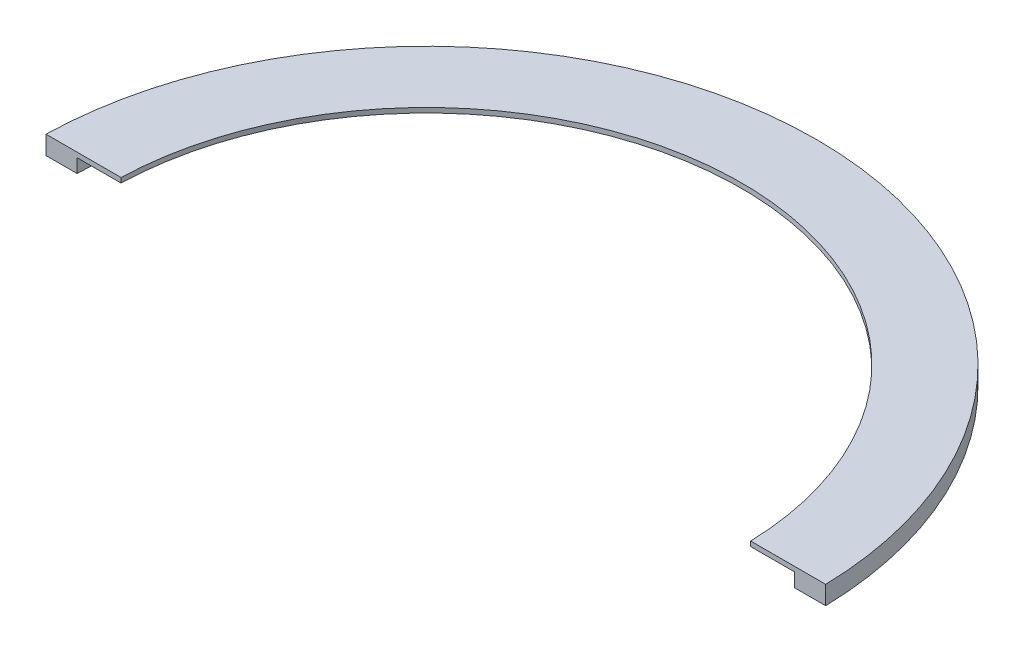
ISO-10303-21;
HEADER;
FILE_DESCRIPTION(('STEP AP214'),'2;1');
FILE_NAME('part.step','',(''),(''),'','','');
FILE_SCHEMA(('AUTOMOTIVE_DESIGN { 1 0 10303 214 1 1 1 1 }'));
ENDSEC;
DATA;
#1=APPLICATION_CONTEXT('core data for automotive mechanical design processes');
#2=APPLICATION_PROTOCOL_DEFINITION('international standard','automotive_design',2000,#1);
#3=PRODUCT_CONTEXT('',#1,'mechanical');
#4=PRODUCT('Part','Part','',(#3));
#5=PRODUCT_RELATED_PRODUCT_CATEGORY('part','',(#4));
#6=PRODUCT_DEFINITION_FORMATION('','',#4);
#7=PRODUCT_DEFINITION_CONTEXT('part definition',#1,'design');
#8=PRODUCT_DEFINITION('design','',#6,#7);
#9=PRODUCT_DEFINITION_SHAPE('','',#8);
#10=(LENGTH_UNIT() NAMED_UNIT(*) SI_UNIT(.MILLI.,.METRE.));
#11=(NAMED_UNIT(*) PLANE_ANGLE_UNIT() SI_UNIT($,.RADIAN.));
#12=(NAMED_UNIT(*) SI_UNIT($,.STERADIAN.) SOLID_ANGLE_UNIT());
#13=UNCERTAINTY_MEASURE_WITH_UNIT(LENGTH_MEASURE(1.E-05),#10,'distance_accuracy_value','');
#14=(GEOMETRIC_REPRESENTATION_CONTEXT(3) GLOBAL_UNCERTAINTY_ASSIGNED_CONTEXT((#13)) GLOBAL_UNIT_ASSIGNED_CONTEXT((#10,
#11,#12)) REPRESENTATION_CONTEXT('',''));
#15=CARTESIAN_POINT('',(0.,0.,0.));
#16=DIRECTION('',(0.,0.,1.));
#17=DIRECTION('',(1.,0.,0.));
#18=AXIS2_PLACEMENT_3D('',#15,#16,#17);
#19=CARTESIAN_POINT('',(0.,0.,0.));
#20=DIRECTION('',(0.,-1.,0.));
#21=DIRECTION('',(0.,0.,-1.));
#22=AXIS2_PLACEMENT_3D('',#19,#20,#21);
#23=CYLINDRICAL_SURFACE('',#22,107.696);
#24=CARTESIAN_POINT('',(0.,1.651,0.));
#25=DIRECTION('',(0.,-1.,0.));
#26=DIRECTION('',(0.,0.,-1.));
#27=AXIS2_PLACEMENT_3D('',#24,#25,#26);
#28=CIRCLE('',#27,107.696);
#29=CARTESIAN_POINT('',(-107.649188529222,1.651,-3.17499999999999));
#30=VERTEX_POINT('',#29);
#31=CARTESIAN_POINT('',(107.649188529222,1.651,-3.17500000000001));
#32=VERTEX_POINT('',#31);
#33=EDGE_CURVE('E12',#30,#32,#28,.T.);
#34=ORIENTED_EDGE('',*,*,#33,.F.);
#35=DIRECTION('',(0.,-1.,0.));
#36=VECTOR('',#35,1.);
#37=CARTESIAN_POINT('',(-107.649188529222,0.,-3.17499999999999));
#38=LINE('',#37,#36);
#39=CARTESIAN_POINT('',(-107.649188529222,0.,-3.17499999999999));
#40=VERTEX_POINT('',#39);
#41=EDGE_CURVE('E107',#40,#30,#38,.F.);
#42=ORIENTED_EDGE('',*,*,#41,.F.);
#43=CARTESIAN_POINT('',(0.,0.,0.));
#44=DIRECTION('',(0.,-1.,0.));
#45=DIRECTION('',(0.,0.,-1.));
#46=AXIS2_PLACEMENT_3D('',#43,#44,#45);
#47=CIRCLE('',#46,107.696);
#48=CARTESIAN_POINT('',(107.649188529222,0.,-3.17500000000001));
#49=VERTEX_POINT('',#48);
#50=EDGE_CURVE('E130',#40,#49,#47,.T.);
#51=ORIENTED_EDGE('',*,*,#50,.T.);
#52=DIRECTION('',(0.,-1.,0.));
#53=VECTOR('',#52,1.);
#54=CARTESIAN_POINT('',(107.649188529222,0.,-3.17500000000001));
#55=LINE('',#54,#53);
#56=EDGE_CURVE('E69',#32,#49,#55,.T.);
#57=ORIENTED_EDGE('',*,*,#56,.F.);
#58=EDGE_LOOP('',(#34,#42,#51,#57));
#59=FACE_BOUND('',#58,.T.);
#60=ADVANCED_FACE('F47',(#59),#23,.F.);
#61=CARTESIAN_POINT('',(-107.696,1.651,0.));
#62=DIRECTION('',(0.,-1.,0.));
#63=DIRECTION('',(0.,0.,-1.));
#64=AXIS2_PLACEMENT_3D('',#61,#62,#63);
#65=PLANE('',#64);
#66=CARTESIAN_POINT('',(0.,1.651,0.));
#67=DIRECTION('',(0.,-1.,0.));
#68=DIRECTION('',(0.,0.,-1.));
#69=AXIS2_PLACEMENT_3D('',#66,#67,#68);
#70=CIRCLE('',#69,133.35);
#71=CARTESIAN_POINT('',(-133.312197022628,1.651,-3.17499999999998));
#72=VERTEX_POINT('',#71);
#73=CARTESIAN_POINT('',(133.312197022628,1.651,-3.17500000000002));
#74=VERTEX_POINT('',#73);
#75=EDGE_CURVE('E54',#72,#74,#70,.T.);
#76=ORIENTED_EDGE('',*,*,#75,.F.);
#77=DIRECTION('',(-1.,0.,0.));
#78=VECTOR('',#77,1.);
#79=CARTESIAN_POINT('',(135.89,1.651,-3.17500000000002));
#80=LINE('',#79,#78);
#81=EDGE_CURVE('E116',#30,#72,#80,.T.);
#82=ORIENTED_EDGE('',*,*,#81,.F.);
#83=ORIENTED_EDGE('',*,*,#33,.T.);
#84=EDGE_CURVE('E100',#74,#32,#80,.T.);
#85=ORIENTED_EDGE('',*,*,#84,.F.);
#86=EDGE_LOOP('',(#76,#82,#83,#85));
#87=FACE_BOUND('',#86,.T.);
#88=ADVANCED_FACE('F112',(#87),#65,.F.);
#89=CARTESIAN_POINT('',(0.,0.,0.));
#90=DIRECTION('',(0.,-1.,0.));
#91=DIRECTION('',(0.,0.,-1.));
#92=AXIS2_PLACEMENT_3D('',#89,#90,#91);
#93=CYLINDRICAL_SURFACE('',#92,133.35);
#94=CARTESIAN_POINT('',(0.,-4.699,0.));
#95=DIRECTION('',(0.,-1.,0.));
#96=DIRECTION('',(0.,0.,-1.));
#97=AXIS2_PLACEMENT_3D('',#94,#95,#96);
#98=CIRCLE('',#97,133.35);
#99=CARTESIAN_POINT('',(-133.312197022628,-4.699,-3.17499999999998));
#100=VERTEX_POINT('',#99);
#101=CARTESIAN_POINT('',(133.312197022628,-4.699,-3.17500000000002));
#102=VERTEX_POINT('',#101);
#103=EDGE_CURVE('E120',#100,#102,#98,.T.);
#104=ORIENTED_EDGE('',*,*,#103,.F.);
#105=DIRECTION('',(0.,-1.,0.));
#106=VECTOR('',#105,1.);
#107=CARTESIAN_POINT('',(-133.312197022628,0.,-3.17499999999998));
#108=LINE('',#107,#106);
#109=EDGE_CURVE('E108',#72,#100,#108,.T.);
#110=ORIENTED_EDGE('',*,*,#109,.F.);
#111=ORIENTED_EDGE('',*,*,#75,.T.);
#112=DIRECTION('',(0.,-1.,0.));
#113=VECTOR('',#112,1.);
#114=CARTESIAN_POINT('',(133.312197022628,0.,-3.17500000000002));
#115=LINE('',#114,#113);
#116=EDGE_CURVE('E97',#102,#74,#115,.F.);
#117=ORIENTED_EDGE('',*,*,#116,.F.);
#118=EDGE_LOOP('',(#104,#110,#111,#117));
#119=FACE_BOUND('',#118,.T.);
#120=ADVANCED_FACE('F119',(#119),#93,.T.);
#121=CARTESIAN_POINT('',(-133.35,-4.699,0.));
#122=DIRECTION('',(0.,1.,0.));
#123=DIRECTION('',(0.,0.,1.));
#124=AXIS2_PLACEMENT_3D('',#121,#122,#123);
#125=PLANE('',#124);
#126=CARTESIAN_POINT('',(0.,-4.699,0.));
#127=DIRECTION('',(0.,-1.,0.));
#128=DIRECTION('',(0.,0.,-1.));
#129=AXIS2_PLACEMENT_3D('',#126,#127,#128);
#130=CIRCLE('',#129,122.7582);
#131=CARTESIAN_POINT('',(-122.717134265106,-4.699,-3.17499999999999));
#132=VERTEX_POINT('',#131);
#133=CARTESIAN_POINT('',(122.717134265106,-4.699,-3.17500000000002));
#134=VERTEX_POINT('',#133);
#135=EDGE_CURVE('E121',#132,#134,#130,.T.);
#136=ORIENTED_EDGE('',*,*,#135,.F.);
#137=DIRECTION('',(1.,0.,0.));
#138=VECTOR('',#137,1.);
#139=CARTESIAN_POINT('',(135.89,-4.699,-3.17500000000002));
#140=LINE('',#139,#138);
#141=EDGE_CURVE('E134',#100,#132,#140,.T.);
#142=ORIENTED_EDGE('',*,*,#141,.F.);
#143=ORIENTED_EDGE('',*,*,#103,.T.);
#144=EDGE_CURVE('E102',#134,#102,#140,.T.);
#145=ORIENTED_EDGE('',*,*,#144,.F.);
#146=EDGE_LOOP('',(#136,#142,#143,#145));
#147=FACE_BOUND('',#146,.T.);
#148=ADVANCED_FACE('F147',(#147),#125,.F.);
#149=CARTESIAN_POINT('',(0.,0.,0.));
#150=DIRECTION('',(0.,-1.,0.));
#151=DIRECTION('',(0.,0.,-1.));
#152=AXIS2_PLACEMENT_3D('',#149,#150,#151);
#153=CYLINDRICAL_SURFACE('',#152,122.7582);
#154=CARTESIAN_POINT('',(0.,0.,0.));
#155=DIRECTION('',(0.,-1.,0.));
#156=DIRECTION('',(0.,0.,-1.));
#157=AXIS2_PLACEMENT_3D('',#154,#155,#156);
#158=CIRCLE('',#157,122.7582);
#159=CARTESIAN_POINT('',(-122.717134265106,0.,-3.17499999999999));
#160=VERTEX_POINT('',#159);
#161=CARTESIAN_POINT('',(122.717134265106,0.,-3.17500000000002));
#162=VERTEX_POINT('',#161);
#163=EDGE_CURVE('E126',#160,#162,#158,.T.);
#164=ORIENTED_EDGE('',*,*,#163,.F.);
#165=DIRECTION('',(0.,-1.,0.));
#166=VECTOR('',#165,1.);
#167=CARTESIAN_POINT('',(-122.717134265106,0.,-3.17499999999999));
#168=LINE('',#167,#166);
#169=EDGE_CURVE('E61',#132,#160,#168,.F.);
#170=ORIENTED_EDGE('',*,*,#169,.F.);
#171=ORIENTED_EDGE('',*,*,#135,.T.);
#172=DIRECTION('',(0.,-1.,0.));
#173=VECTOR('',#172,1.);
#174=CARTESIAN_POINT('',(122.717134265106,0.,-3.17500000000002));
#175=LINE('',#174,#173);
#176=EDGE_CURVE('E138',#162,#134,#175,.T.);
#177=ORIENTED_EDGE('',*,*,#176,.F.);
#178=EDGE_LOOP('',(#164,#170,#171,#177));
#179=FACE_BOUND('',#178,.T.);
#180=ADVANCED_FACE('F151',(#179),#153,.F.);
#181=CARTESIAN_POINT('',(-122.7582,0.,0.));
#182=DIRECTION('',(0.,1.,0.));
#183=DIRECTION('',(0.,0.,1.));
#184=AXIS2_PLACEMENT_3D('',#181,#182,#183);
#185=PLANE('',#184);
#186=ORIENTED_EDGE('',*,*,#50,.F.);
#187=DIRECTION('',(1.,0.,0.));
#188=VECTOR('',#187,1.);
#189=CARTESIAN_POINT('',(135.89,0.,-3.17500000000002));
#190=LINE('',#189,#188);
#191=EDGE_CURVE('E136',#160,#40,#190,.T.);
#192=ORIENTED_EDGE('',*,*,#191,.F.);
#193=ORIENTED_EDGE('',*,*,#163,.T.);
#194=EDGE_CURVE('E115',#49,#162,#190,.T.);
#195=ORIENTED_EDGE('',*,*,#194,.F.);
#196=EDGE_LOOP('',(#186,#192,#193,#195));
#197=FACE_BOUND('',#196,.T.);
#198=ADVANCED_FACE('F154',(#197),#185,.F.);
#199=CARTESIAN_POINT('',(135.89,-4.7,-3.17500000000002));
#200=DIRECTION('',(0.,0.,-1.));
#201=DIRECTION('',(-1.,0.,0.));
#202=AXIS2_PLACEMENT_3D('',#199,#200,#201);
#203=PLANE('',#202);
#204=ORIENTED_EDGE('',*,*,#56,.T.);
#205=ORIENTED_EDGE('',*,*,#194,.T.);
#206=ORIENTED_EDGE('',*,*,#176,.T.);
#207=ORIENTED_EDGE('',*,*,#144,.T.);
#208=ORIENTED_EDGE('',*,*,#116,.T.);
#209=ORIENTED_EDGE('',*,*,#84,.T.);
#210=EDGE_LOOP('',(#204,#205,#206,#207,#208,#209));
#211=FACE_BOUND('',#210,.T.);
#212=ADVANCED_FACE('F99',(#211),#203,.F.);
#213=ORIENTED_EDGE('',*,*,#41,.T.);
#214=ORIENTED_EDGE('',*,*,#81,.T.);
#215=ORIENTED_EDGE('',*,*,#109,.T.);
#216=ORIENTED_EDGE('',*,*,#141,.T.);
#217=ORIENTED_EDGE('',*,*,#169,.T.);
#218=ORIENTED_EDGE('',*,*,#191,.T.);
#219=EDGE_LOOP('',(#213,#214,#215,#216,#217,#218));
#220=FACE_BOUND('',#219,.T.);
#221=ADVANCED_FACE('F144',(#220),#203,.F.);
#222=CLOSED_SHELL('',(#60,#88,#120,#148,#180,#198,#212,#221));
#223=MANIFOLD_SOLID_BREP('B2',#222);
#224=ADVANCED_BREP_SHAPE_REPRESENTATION('',(#18,#223),#14);
#225=SHAPE_DEFINITION_REPRESENTATION(#9,#224);
ENDSEC;
END-ISO-10303-21;
